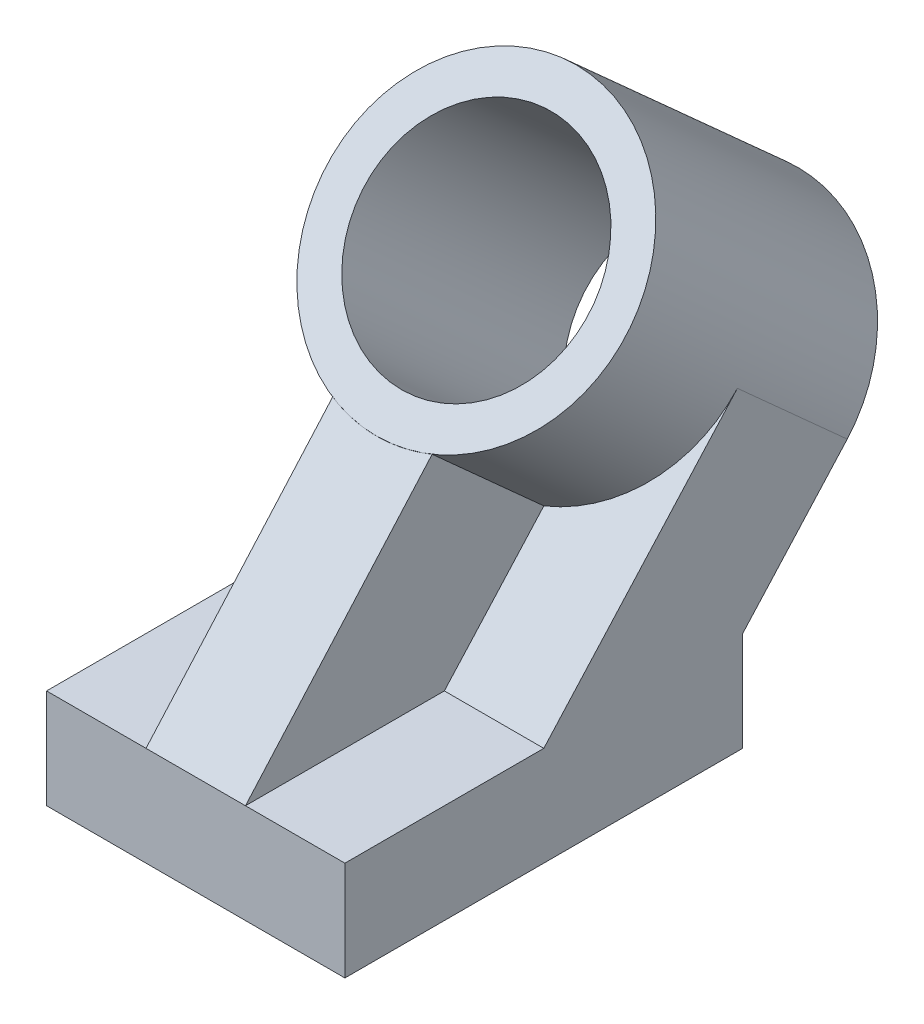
from build123d import *

# Parameters (mm, degrees)
BOSS_EXTRUDE1_DEPTH = 38.1
SKETCH3_R           = 38.1
BOSS_EXTRUDE2_DEPTH = 76.2
SKETCH4_R           = 28.575
CUT_EXTRUDE1_DEPTH  = 211.549798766
RIB23_REACH         = 209.738
SKETCH9_WALL_W      = 496.790006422
SKETCH9_WALL_H      = 25.4


with BuildPart() as part:
    # Sketch1 → Boss-Extrude1 (new, symmetric)
    with BuildSketch(Plane(origin=(0, 0, 0), x_dir=(0, 0, -1), z_dir=(1, 0, 0))):
        Polygon((0, 0), (0, 25.4), (50.8, 25.4), (100.244555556, 80.313742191), (128.299578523, 55.052886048), (101.6, 25.4), (101.6, 0), align=None)
    extrude(amount=BOSS_EXTRUDE1_DEPTH, both=True)

    # Sketch3 → Boss-Extrude2 (add)
    with BuildSketch(Plane(origin=(0, -39.149223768, -43.479617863), x_dir=(-1, 0, 0), z_dir=(0, -0.6691306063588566, -0.7431448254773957))):
        with Locations(Location((0, 126.761442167, 0), (0, 0, 90))):
            Circle(SKETCH3_R)
    extrude(amount=-BOSS_EXTRUDE2_DEPTH)

    # Sketch4 → Cut-Extrude1 (cut, through all)
    with BuildSketch(Plane(origin=(0, 11.838528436, 13.148017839), x_dir=(1, 0, 0), z_dir=(0, 0.6691306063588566, 0.7431448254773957))):
        with Locations(Location((0, 126.761442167, 0), (0, 0, 270))):
            Circle(SKETCH4_R)
    extrude(amount=-CUT_EXTRUDE1_DEPTH, mode=Mode.SUBTRACT)

    # Sketch9 wall → Rib23 (add, up to next)
    with BuildSketch(Plane(origin=(0, 55.102637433, -26.275767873), x_dir=(0, -0.748992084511, 0.662578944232), z_dir=(0, 0.662578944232, 0.748992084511)), mode=Mode.PRIVATE) as rib23_sk1:
        Rectangle(SKETCH9_WALL_W, SKETCH9_WALL_H)
    rib23_tool1 = extrude(rib23_sk1.sketch, amount=-RIB23_REACH, mode=Mode.PRIVATE) - part.part
    add(rib23_tool1.solids().sort_by_distance((0, 55.102637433, -26.275767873))[0])


solid = part.part
